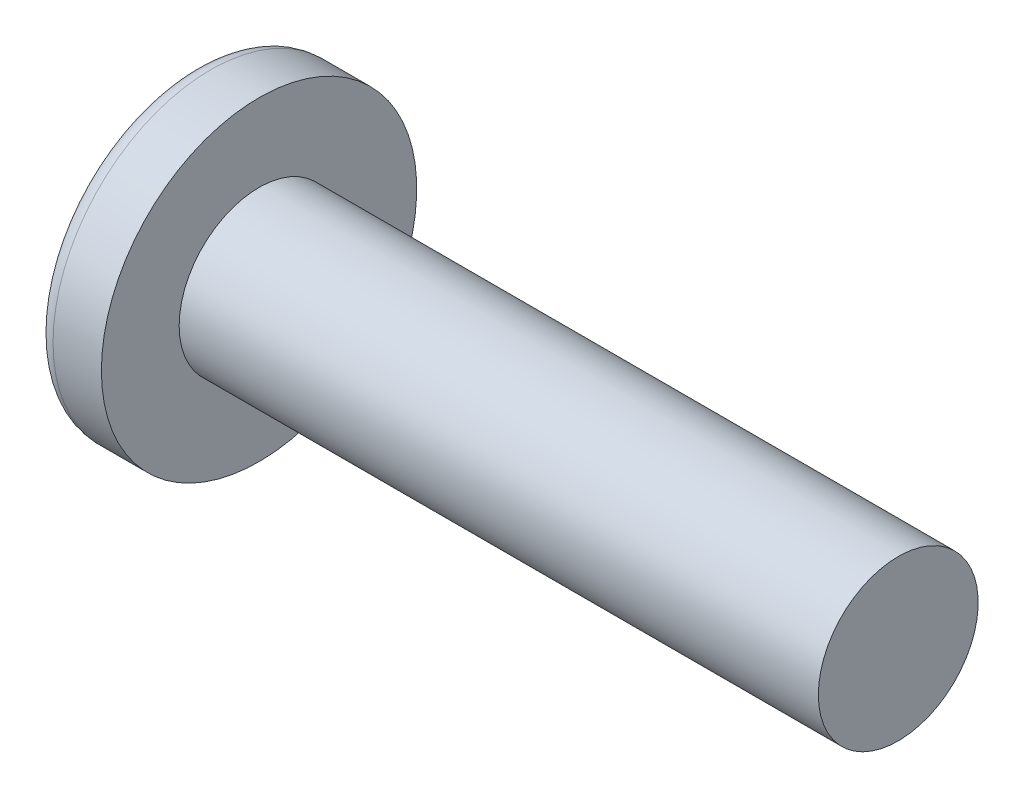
ISO-10303-21;
HEADER;
FILE_DESCRIPTION(('STEP AP214'),'2;1');
FILE_NAME('part.step','',(''),(''),'','','');
FILE_SCHEMA(('AUTOMOTIVE_DESIGN { 1 0 10303 214 1 1 1 1 }'));
ENDSEC;
DATA;
#1=APPLICATION_CONTEXT('core data for automotive mechanical design processes');
#2=APPLICATION_PROTOCOL_DEFINITION('international standard','automotive_design',2000,#1);
#3=PRODUCT_CONTEXT('',#1,'mechanical');
#4=PRODUCT('Part','Part','',(#3));
#5=PRODUCT_RELATED_PRODUCT_CATEGORY('part','',(#4));
#6=PRODUCT_DEFINITION_FORMATION('','',#4);
#7=PRODUCT_DEFINITION_CONTEXT('part definition',#1,'design');
#8=PRODUCT_DEFINITION('design','',#6,#7);
#9=PRODUCT_DEFINITION_SHAPE('','',#8);
#10=(LENGTH_UNIT() NAMED_UNIT(*) SI_UNIT(.MILLI.,.METRE.));
#11=(NAMED_UNIT(*) PLANE_ANGLE_UNIT() SI_UNIT($,.RADIAN.));
#12=(NAMED_UNIT(*) SI_UNIT($,.STERADIAN.) SOLID_ANGLE_UNIT());
#13=UNCERTAINTY_MEASURE_WITH_UNIT(LENGTH_MEASURE(1.E-05),#10,'distance_accuracy_value','');
#14=(GEOMETRIC_REPRESENTATION_CONTEXT(3) GLOBAL_UNCERTAINTY_ASSIGNED_CONTEXT((#13)) GLOBAL_UNIT_ASSIGNED_CONTEXT((#10,
#11,#12)) REPRESENTATION_CONTEXT('',''));
#15=CARTESIAN_POINT('',(0.,0.,0.));
#16=DIRECTION('',(0.,0.,1.));
#17=DIRECTION('',(1.,0.,0.));
#18=AXIS2_PLACEMENT_3D('',#15,#16,#17);
#19=CARTESIAN_POINT('',(15.24,0.,0.));
#20=DIRECTION('',(-1.,0.,0.));
#21=DIRECTION('',(0.,1.,0.));
#22=AXIS2_PLACEMENT_3D('',#19,#20,#21);
#23=SPHERICAL_SURFACE('',#22,15.24);
#24=CARTESIAN_POINT('',(2.92722732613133,0.,0.));
#25=DIRECTION('',(-1.,0.,0.));
#26=DIRECTION('',(0.,0.,1.));
#27=AXIS2_PLACEMENT_3D('',#24,#25,#26);
#28=CIRCLE('',#27,8.98071428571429);
#29=CARTESIAN_POINT('',(2.92722732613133,0.,8.98071428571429));
#30=VERTEX_POINT('',#29);
#31=EDGE_CURVE('E159',#30,#30,#28,.T.);
#32=ORIENTED_EDGE('',*,*,#31,.T.);
#33=EDGE_LOOP('',(#32));
#34=FACE_BOUND('',#33,.T.);
#35=CARTESIAN_POINT('',(15.2364523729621,-0.0501047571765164,0.));
#36=DIRECTION('',(-0.0706273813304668,-0.997502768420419,0.));
#37=DIRECTION('',(0.99750276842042,-0.0706273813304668,0.));
#38=AXIS2_PLACEMENT_3D('',#35,#36,#37);
#39=CIRCLE('',#38,15.239917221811);
#40=CARTESIAN_POINT('',(0.995146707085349,0.95823943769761,5.33137241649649));
#41=VERTEX_POINT('',#40);
#42=CARTESIAN_POINT('',(0.0689357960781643,1.02381905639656,1.02381905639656));
#43=VERTEX_POINT('',#42);
#44=EDGE_CURVE('E190',#41,#43,#39,.T.);
#45=ORIENTED_EDGE('',*,*,#44,.F.);
#46=CARTESIAN_POINT('',(12.5278255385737,0.,-3.52983797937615));
#47=DIRECTION('',(0.609275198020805,0.,0.79295884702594));
#48=DIRECTION('',(0.79295884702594,0.,-0.609275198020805));
#49=AXIS2_PLACEMENT_3D('',#46,#47,#48);
#50=CIRCLE('',#49,14.5753886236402);
#51=CARTESIAN_POINT('',(0.995146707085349,-0.958239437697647,5.33137241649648));
#52=VERTEX_POINT('',#51);
#53=EDGE_CURVE('E155',#41,#52,#50,.T.);
#54=ORIENTED_EDGE('',*,*,#53,.T.);
#55=CARTESIAN_POINT('',(15.2364523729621,0.0501047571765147,0.));
#56=DIRECTION('',(-0.0706273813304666,0.997502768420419,0.));
#57=DIRECTION('',(-0.99750276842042,-0.0706273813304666,0.));
#58=AXIS2_PLACEMENT_3D('',#55,#56,#57);
#59=CIRCLE('',#58,15.239917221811);
#60=CARTESIAN_POINT('',(0.0689357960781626,-1.02381905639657,1.02381905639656));
#61=VERTEX_POINT('',#60);
#62=EDGE_CURVE('E111',#61,#52,#59,.T.);
#63=ORIENTED_EDGE('',*,*,#62,.F.);
#64=CARTESIAN_POINT('',(15.2364523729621,0.,-0.0501047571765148));
#65=DIRECTION('',(-0.0706273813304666,0.,-0.997502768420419));
#66=DIRECTION('',(-0.99750276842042,0.,0.0706273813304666));
#67=AXIS2_PLACEMENT_3D('',#64,#65,#66);
#68=CIRCLE('',#67,15.239917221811);
#69=CARTESIAN_POINT('',(0.995146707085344,-5.33137241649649,0.958239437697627));
#70=VERTEX_POINT('',#69);
#71=EDGE_CURVE('E136',#70,#61,#68,.T.);
#72=ORIENTED_EDGE('',*,*,#71,.F.);
#73=CARTESIAN_POINT('',(12.5278255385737,3.52983797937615,0.));
#74=DIRECTION('',(0.609275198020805,-0.79295884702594,0.));
#75=DIRECTION('',(0.79295884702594,0.609275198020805,0.));
#76=AXIS2_PLACEMENT_3D('',#73,#74,#75);
#77=CIRCLE('',#76,14.5753886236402);
#78=CARTESIAN_POINT('',(0.995146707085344,-5.33137241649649,-0.958239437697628));
#79=VERTEX_POINT('',#78);
#80=EDGE_CURVE('E144',#70,#79,#77,.T.);
#81=ORIENTED_EDGE('',*,*,#80,.T.);
#82=CARTESIAN_POINT('',(15.2364523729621,0.,0.0501047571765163));
#83=DIRECTION('',(-0.0706273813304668,0.,0.997502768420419));
#84=DIRECTION('',(0.99750276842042,0.,0.0706273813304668));
#85=AXIS2_PLACEMENT_3D('',#82,#83,#84);
#86=CIRCLE('',#85,15.239917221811);
#87=CARTESIAN_POINT('',(0.0689357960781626,-1.02381905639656,-1.02381905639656));
#88=VERTEX_POINT('',#87);
#89=EDGE_CURVE('E54',#88,#79,#86,.T.);
#90=ORIENTED_EDGE('',*,*,#89,.F.);
#91=CARTESIAN_POINT('',(0.995146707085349,-0.958239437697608,-5.33137241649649));
#92=VERTEX_POINT('',#91);
#93=EDGE_CURVE('E197',#92,#88,#59,.T.);
#94=ORIENTED_EDGE('',*,*,#93,.F.);
#95=CARTESIAN_POINT('',(12.5278255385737,0.,3.52983797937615));
#96=DIRECTION('',(0.609275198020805,0.,-0.79295884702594));
#97=DIRECTION('',(-0.79295884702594,0.,-0.609275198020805));
#98=AXIS2_PLACEMENT_3D('',#95,#96,#97);
#99=CIRCLE('',#98,14.5753886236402);
#100=CARTESIAN_POINT('',(0.995146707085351,0.958239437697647,-5.33137241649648));
#101=VERTEX_POINT('',#100);
#102=EDGE_CURVE('E137',#92,#101,#99,.T.);
#103=ORIENTED_EDGE('',*,*,#102,.T.);
#104=CARTESIAN_POINT('',(0.0689357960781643,1.02381905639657,-1.02381905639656));
#105=VERTEX_POINT('',#104);
#106=EDGE_CURVE('E185',#105,#101,#39,.T.);
#107=ORIENTED_EDGE('',*,*,#106,.F.);
#108=CARTESIAN_POINT('',(0.995146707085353,5.33137241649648,-0.958239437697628));
#109=VERTEX_POINT('',#108);
#110=EDGE_CURVE('E47',#109,#105,#86,.T.);
#111=ORIENTED_EDGE('',*,*,#110,.F.);
#112=CARTESIAN_POINT('',(12.5278255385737,-3.52983797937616,0.));
#113=DIRECTION('',(0.609275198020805,0.79295884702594,0.));
#114=DIRECTION('',(-0.79295884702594,0.609275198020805,0.));
#115=AXIS2_PLACEMENT_3D('',#112,#113,#114);
#116=CIRCLE('',#115,14.5753886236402);
#117=CARTESIAN_POINT('',(0.995146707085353,5.33137241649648,0.958239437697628));
#118=VERTEX_POINT('',#117);
#119=EDGE_CURVE('E11',#109,#118,#116,.T.);
#120=ORIENTED_EDGE('',*,*,#119,.T.);
#121=EDGE_CURVE('E173',#43,#118,#68,.T.);
#122=ORIENTED_EDGE('',*,*,#121,.F.);
#123=EDGE_LOOP('',(#45,#54,#63,#72,#81,#90,#94,#103,#107,#111,#120,#122));
#124=FACE_BOUND('',#123,.T.);
#125=ADVANCED_FACE('F39',(#34,#124),#23,.T.);
#126=CARTESIAN_POINT('',(7.9338156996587,0.,-0.466952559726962));
#127=DIRECTION('',(-0.0706273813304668,0.,0.997502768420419));
#128=DIRECTION('',(0.99750276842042,0.,0.0706273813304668));
#129=AXIS2_PLACEMENT_3D('',#126,#127,#128);
#130=PLANE('',#129);
#131=ORIENTED_EDGE('',*,*,#110,.T.);
#132=DIRECTION('',(0.995024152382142,-0.0704518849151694,0.0704518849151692));
#133=VECTOR('',#132,1.);
#134=CARTESIAN_POINT('',(7.96654969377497,0.464634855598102,-0.464634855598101));
#135=LINE('',#134,#133);
#136=CARTESIAN_POINT('',(7.2644,0.514350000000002,-0.514349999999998));
#137=VERTEX_POINT('',#136);
#138=EDGE_CURVE('E179',#105,#137,#135,.T.);
#139=ORIENTED_EDGE('',*,*,#138,.T.);
#140=DIRECTION('',(0.791711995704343,-0.608317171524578,0.056056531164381));
#141=VECTOR('',#140,1.);
#142=CARTESIAN_POINT('',(0.,6.096,-1.0287));
#143=LINE('',#142,#141);
#144=EDGE_CURVE('E160',#109,#137,#143,.T.);
#145=ORIENTED_EDGE('',*,*,#144,.F.);
#146=EDGE_LOOP('',(#131,#139,#145));
#147=FACE_BOUND('',#146,.T.);
#148=ADVANCED_FACE('F178',(#147),#130,.T.);
#149=DIRECTION('',(0.791711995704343,0.608317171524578,0.056056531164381));
#150=VECTOR('',#149,1.);
#151=CARTESIAN_POINT('',(0.,-6.096,-1.0287));
#152=LINE('',#151,#150);
#153=CARTESIAN_POINT('',(7.2644,-0.51435,-0.51435));
#154=VERTEX_POINT('',#153);
#155=EDGE_CURVE('E145',#79,#154,#152,.T.);
#156=ORIENTED_EDGE('',*,*,#155,.T.);
#157=DIRECTION('',(-0.995024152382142,-0.0704518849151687,-0.0704518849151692));
#158=VECTOR('',#157,1.);
#159=CARTESIAN_POINT('',(7.96654969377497,-0.464634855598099,-0.464634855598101));
#160=LINE('',#159,#158);
#161=EDGE_CURVE('E200',#154,#88,#160,.T.);
#162=ORIENTED_EDGE('',*,*,#161,.T.);
#163=ORIENTED_EDGE('',*,*,#89,.T.);
#164=EDGE_LOOP('',(#156,#162,#163));
#165=FACE_BOUND('',#164,.T.);
#166=ADVANCED_FACE('F215',(#165),#130,.T.);
#167=CARTESIAN_POINT('',(7.9338156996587,0.,0.466952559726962));
#168=DIRECTION('',(-0.0706273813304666,0.,-0.997502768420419));
#169=DIRECTION('',(-0.99750276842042,0.,0.0706273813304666));
#170=AXIS2_PLACEMENT_3D('',#167,#168,#169);
#171=PLANE('',#170);
#172=DIRECTION('',(0.791711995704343,-0.608317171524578,-0.0560565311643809));
#173=VECTOR('',#172,1.);
#174=CARTESIAN_POINT('',(0.,6.096,1.0287));
#175=LINE('',#174,#173);
#176=CARTESIAN_POINT('',(7.2644,0.51435,0.51435));
#177=VERTEX_POINT('',#176);
#178=EDGE_CURVE('E216',#118,#177,#175,.T.);
#179=ORIENTED_EDGE('',*,*,#178,.T.);
#180=DIRECTION('',(-0.995024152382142,0.0704518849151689,0.070451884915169));
#181=VECTOR('',#180,1.);
#182=CARTESIAN_POINT('',(7.96654969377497,0.464634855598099,0.464634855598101));
#183=LINE('',#182,#181);
#184=EDGE_CURVE('E194',#177,#43,#183,.T.);
#185=ORIENTED_EDGE('',*,*,#184,.T.);
#186=ORIENTED_EDGE('',*,*,#121,.T.);
#187=EDGE_LOOP('',(#179,#185,#186));
#188=FACE_BOUND('',#187,.T.);
#189=ADVANCED_FACE('F220',(#188),#171,.T.);
#190=ORIENTED_EDGE('',*,*,#71,.T.);
#191=DIRECTION('',(0.995024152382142,0.0704518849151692,-0.070451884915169));
#192=VECTOR('',#191,1.);
#193=CARTESIAN_POINT('',(7.96654969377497,-0.464634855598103,0.464634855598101));
#194=LINE('',#193,#192);
#195=CARTESIAN_POINT('',(7.2644,-0.514350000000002,0.514349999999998));
#196=VERTEX_POINT('',#195);
#197=EDGE_CURVE('E109',#61,#196,#194,.T.);
#198=ORIENTED_EDGE('',*,*,#197,.T.);
#199=DIRECTION('',(0.791711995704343,0.608317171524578,-0.0560565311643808));
#200=VECTOR('',#199,1.);
#201=CARTESIAN_POINT('',(0.,-6.096,1.0287));
#202=LINE('',#201,#200);
#203=EDGE_CURVE('E134',#70,#196,#202,.T.);
#204=ORIENTED_EDGE('',*,*,#203,.F.);
#205=EDGE_LOOP('',(#190,#198,#204));
#206=FACE_BOUND('',#205,.T.);
#207=ADVANCED_FACE('F133',(#206),#171,.T.);
#208=CARTESIAN_POINT('',(-25.4,0.,0.));
#209=DIRECTION('',(-1.,0.,0.));
#210=DIRECTION('',(0.,0.,1.));
#211=AXIS2_PLACEMENT_3D('',#208,#209,#210);
#212=CYLINDRICAL_SURFACE('',#211,4.7625);
#213=CARTESIAN_POINT('',(44.7294,0.,0.));
#214=DIRECTION('',(-1.,0.,0.));
#215=DIRECTION('',(0.,0.,1.));
#216=AXIS2_PLACEMENT_3D('',#213,#214,#215);
#217=CIRCLE('',#216,4.7625);
#218=CARTESIAN_POINT('',(44.7294,0.,4.7625));
#219=VERTEX_POINT('',#218);
#220=EDGE_CURVE('E156',#219,#219,#217,.T.);
#221=ORIENTED_EDGE('',*,*,#220,.T.);
#222=EDGE_LOOP('',(#221));
#223=FACE_BOUND('',#222,.T.);
#224=CARTESIAN_POINT('',(6.6294,0.,0.));
#225=DIRECTION('',(-1.,0.,0.));
#226=DIRECTION('',(0.,0.,1.));
#227=AXIS2_PLACEMENT_3D('',#224,#225,#226);
#228=CIRCLE('',#227,4.7625);
#229=CARTESIAN_POINT('',(6.6294,0.,4.7625));
#230=VERTEX_POINT('',#229);
#231=EDGE_CURVE('E169',#230,#230,#228,.T.);
#232=ORIENTED_EDGE('',*,*,#231,.F.);
#233=EDGE_LOOP('',(#232));
#234=FACE_BOUND('',#233,.T.);
#235=ADVANCED_FACE('F41',(#223,#234),#212,.T.);
#236=CARTESIAN_POINT('',(6.6294,4.7625,0.));
#237=DIRECTION('',(-1.,0.,0.));
#238=DIRECTION('',(0.,0.,1.));
#239=AXIS2_PLACEMENT_3D('',#236,#237,#238);
#240=PLANE('',#239);
#241=CARTESIAN_POINT('',(6.6294,0.,0.));
#242=DIRECTION('',(-1.,0.,0.));
#243=DIRECTION('',(0.,0.,1.));
#244=AXIS2_PLACEMENT_3D('',#241,#242,#243);
#245=CIRCLE('',#244,9.398);
#246=CARTESIAN_POINT('',(6.6294,0.,9.398));
#247=VERTEX_POINT('',#246);
#248=EDGE_CURVE('E166',#247,#247,#245,.T.);
#249=ORIENTED_EDGE('',*,*,#248,.F.);
#250=EDGE_LOOP('',(#249));
#251=FACE_BOUND('',#250,.T.);
#252=ORIENTED_EDGE('',*,*,#231,.T.);
#253=EDGE_LOOP('',(#252));
#254=FACE_BOUND('',#253,.T.);
#255=ADVANCED_FACE('F249',(#251,#254),#240,.F.);
#256=CARTESIAN_POINT('',(-25.4,0.,0.));
#257=DIRECTION('',(-1.,0.,0.));
#258=DIRECTION('',(0.,0.,1.));
#259=AXIS2_PLACEMENT_3D('',#256,#257,#258);
#260=CYLINDRICAL_SURFACE('',#259,9.398);
#261=ORIENTED_EDGE('',*,*,#248,.T.);
#262=EDGE_LOOP('',(#261));
#263=FACE_BOUND('',#262,.T.);
#264=CARTESIAN_POINT('',(3.74807883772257,0.,0.));
#265=DIRECTION('',(-1.,0.,0.));
#266=DIRECTION('',(0.,0.,1.));
#267=AXIS2_PLACEMENT_3D('',#264,#265,#266);
#268=CIRCLE('',#267,9.398);
#269=CARTESIAN_POINT('',(3.74807883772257,0.,9.398));
#270=VERTEX_POINT('',#269);
#271=EDGE_CURVE('E163',#270,#270,#268,.T.);
#272=ORIENTED_EDGE('',*,*,#271,.F.);
#273=EDGE_LOOP('',(#272));
#274=FACE_BOUND('',#273,.T.);
#275=ADVANCED_FACE('F246',(#263,#274),#260,.T.);
#276=CARTESIAN_POINT('',(3.74807883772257,0.,0.));
#277=DIRECTION('',(-1.,0.,0.));
#278=DIRECTION('',(0.,0.,1.));
#279=AXIS2_PLACEMENT_3D('',#276,#277,#278);
#280=TOROIDAL_SURFACE('',#279,8.382,1.016);
#281=ORIENTED_EDGE('',*,*,#271,.T.);
#282=EDGE_LOOP('',(#281));
#283=FACE_BOUND('',#282,.T.);
#284=ORIENTED_EDGE('',*,*,#31,.F.);
#285=EDGE_LOOP('',(#284));
#286=FACE_BOUND('',#285,.T.);
#287=ADVANCED_FACE('F243',(#283,#286),#280,.T.);
#288=CARTESIAN_POINT('',(44.7294,4.7625,0.));
#289=DIRECTION('',(1.,0.,0.));
#290=DIRECTION('',(0.,0.,-1.));
#291=AXIS2_PLACEMENT_3D('',#288,#289,#290);
#292=PLANE('',#291);
#293=ORIENTED_EDGE('',*,*,#220,.F.);
#294=EDGE_LOOP('',(#293));
#295=FACE_BOUND('',#294,.T.);
#296=ADVANCED_FACE('F241',(#295),#292,.T.);
#297=CARTESIAN_POINT('',(0.,6.096,1.0287));
#298=DIRECTION('',(0.609275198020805,0.79295884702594,0.));
#299=DIRECTION('',(-0.79295884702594,0.609275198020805,0.));
#300=AXIS2_PLACEMENT_3D('',#297,#298,#299);
#301=PLANE('',#300);
#302=ORIENTED_EDGE('',*,*,#144,.T.);
#303=DIRECTION('',(0.,0.,-1.));
#304=VECTOR('',#303,1.);
#305=CARTESIAN_POINT('',(7.2644,0.51435,0.51435));
#306=LINE('',#305,#304);
#307=EDGE_CURVE('E127',#177,#137,#306,.T.);
#308=ORIENTED_EDGE('',*,*,#307,.F.);
#309=ORIENTED_EDGE('',*,*,#178,.F.);
#310=ORIENTED_EDGE('',*,*,#119,.F.);
#311=EDGE_LOOP('',(#302,#308,#309,#310));
#312=FACE_BOUND('',#311,.T.);
#313=ADVANCED_FACE('F219',(#312),#301,.F.);
#314=CARTESIAN_POINT('',(7.2644,-0.51435,-0.51435));
#315=DIRECTION('',(0.609275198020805,-0.79295884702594,0.));
#316=DIRECTION('',(0.79295884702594,0.609275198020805,0.));
#317=AXIS2_PLACEMENT_3D('',#314,#315,#316);
#318=PLANE('',#317);
#319=ORIENTED_EDGE('',*,*,#203,.T.);
#320=DIRECTION('',(0.,0.,1.));
#321=VECTOR('',#320,1.);
#322=CARTESIAN_POINT('',(7.2644,-0.51435,-0.51435));
#323=LINE('',#322,#321);
#324=EDGE_CURVE('E126',#154,#196,#323,.T.);
#325=ORIENTED_EDGE('',*,*,#324,.F.);
#326=ORIENTED_EDGE('',*,*,#155,.F.);
#327=ORIENTED_EDGE('',*,*,#80,.F.);
#328=EDGE_LOOP('',(#319,#325,#326,#327));
#329=FACE_BOUND('',#328,.T.);
#330=ADVANCED_FACE('F141',(#329),#318,.F.);
#331=CARTESIAN_POINT('',(7.2644,0.51435,-0.51435));
#332=DIRECTION('',(-1.,0.,0.));
#333=DIRECTION('',(0.,0.,1.));
#334=AXIS2_PLACEMENT_3D('',#331,#332,#333);
#335=PLANE('',#334);
#336=DIRECTION('',(0.,1.,0.));
#337=VECTOR('',#336,1.);
#338=CARTESIAN_POINT('',(7.2644,-0.51435,-0.51435));
#339=LINE('',#338,#337);
#340=EDGE_CURVE('E149',#154,#137,#339,.T.);
#341=ORIENTED_EDGE('',*,*,#340,.F.);
#342=ORIENTED_EDGE('',*,*,#324,.T.);
#343=DIRECTION('',(0.,-1.,0.));
#344=VECTOR('',#343,1.);
#345=CARTESIAN_POINT('',(7.2644,0.51435,0.51435));
#346=LINE('',#345,#344);
#347=EDGE_CURVE('E118',#177,#196,#346,.T.);
#348=ORIENTED_EDGE('',*,*,#347,.F.);
#349=ORIENTED_EDGE('',*,*,#307,.T.);
#350=EDGE_LOOP('',(#341,#342,#348,#349));
#351=FACE_BOUND('',#350,.T.);
#352=ADVANCED_FACE('F147',(#351),#335,.T.);
#353=CARTESIAN_POINT('',(7.2644,0.514350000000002,-0.514349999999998));
#354=DIRECTION('',(0.609275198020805,0.,-0.79295884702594));
#355=DIRECTION('',(0.79295884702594,0.,0.609275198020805));
#356=AXIS2_PLACEMENT_3D('',#353,#354,#355);
#357=PLANE('',#356);
#358=DIRECTION('',(0.791711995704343,0.0560565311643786,0.608317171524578));
#359=VECTOR('',#358,1.);
#360=CARTESIAN_POINT('',(0.,-1.02869999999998,-6.096));
#361=LINE('',#360,#359);
#362=EDGE_CURVE('E205',#92,#154,#361,.T.);
#363=ORIENTED_EDGE('',*,*,#362,.T.);
#364=ORIENTED_EDGE('',*,*,#340,.T.);
#365=DIRECTION('',(0.791711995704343,-0.0560565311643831,0.608317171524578));
#366=VECTOR('',#365,1.);
#367=CARTESIAN_POINT('',(0.,1.02870000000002,-6.096));
#368=LINE('',#367,#366);
#369=EDGE_CURVE('E115',#101,#137,#368,.T.);
#370=ORIENTED_EDGE('',*,*,#369,.F.);
#371=ORIENTED_EDGE('',*,*,#102,.F.);
#372=EDGE_LOOP('',(#363,#364,#370,#371));
#373=FACE_BOUND('',#372,.T.);
#374=ADVANCED_FACE('F210',(#373),#357,.F.);
#375=CARTESIAN_POINT('',(7.9338156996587,-0.466952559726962,0.));
#376=DIRECTION('',(-0.0706273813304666,0.997502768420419,0.));
#377=DIRECTION('',(-0.99750276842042,-0.0706273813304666,0.));
#378=AXIS2_PLACEMENT_3D('',#375,#376,#377);
#379=PLANE('',#378);
#380=ORIENTED_EDGE('',*,*,#93,.T.);
#381=ORIENTED_EDGE('',*,*,#161,.F.);
#382=ORIENTED_EDGE('',*,*,#362,.F.);
#383=EDGE_LOOP('',(#380,#381,#382));
#384=FACE_BOUND('',#383,.T.);
#385=ADVANCED_FACE('F214',(#384),#379,.T.);
#386=CARTESIAN_POINT('',(7.9338156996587,0.466952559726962,0.));
#387=DIRECTION('',(-0.0706273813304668,-0.997502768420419,0.));
#388=DIRECTION('',(0.99750276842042,-0.0706273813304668,0.));
#389=AXIS2_PLACEMENT_3D('',#386,#387,#388);
#390=PLANE('',#389);
#391=ORIENTED_EDGE('',*,*,#106,.T.);
#392=ORIENTED_EDGE('',*,*,#369,.T.);
#393=ORIENTED_EDGE('',*,*,#138,.F.);
#394=EDGE_LOOP('',(#391,#392,#393));
#395=FACE_BOUND('',#394,.T.);
#396=ADVANCED_FACE('F208',(#395),#390,.T.);
#397=CARTESIAN_POINT('',(0.,-1.02870000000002,6.096));
#398=DIRECTION('',(0.609275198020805,0.,0.79295884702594));
#399=DIRECTION('',(-0.79295884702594,0.,0.609275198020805));
#400=AXIS2_PLACEMENT_3D('',#397,#398,#399);
#401=PLANE('',#400);
#402=DIRECTION('',(0.791711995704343,-0.0560565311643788,-0.608317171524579));
#403=VECTOR('',#402,1.);
#404=CARTESIAN_POINT('',(0.,1.02869999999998,6.096));
#405=LINE('',#404,#403);
#406=EDGE_CURVE('E114',#41,#177,#405,.T.);
#407=ORIENTED_EDGE('',*,*,#406,.T.);
#408=ORIENTED_EDGE('',*,*,#347,.T.);
#409=DIRECTION('',(0.791711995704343,0.056056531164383,-0.608317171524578));
#410=VECTOR('',#409,1.);
#411=CARTESIAN_POINT('',(0.,-1.02870000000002,6.096));
#412=LINE('',#411,#410);
#413=EDGE_CURVE('E105',#52,#196,#412,.T.);
#414=ORIENTED_EDGE('',*,*,#413,.F.);
#415=ORIENTED_EDGE('',*,*,#53,.F.);
#416=EDGE_LOOP('',(#407,#408,#414,#415));
#417=FACE_BOUND('',#416,.T.);
#418=ADVANCED_FACE('F119',(#417),#401,.F.);
#419=ORIENTED_EDGE('',*,*,#44,.T.);
#420=ORIENTED_EDGE('',*,*,#184,.F.);
#421=ORIENTED_EDGE('',*,*,#406,.F.);
#422=EDGE_LOOP('',(#419,#420,#421));
#423=FACE_BOUND('',#422,.T.);
#424=ADVANCED_FACE('F221',(#423),#390,.T.);
#425=ORIENTED_EDGE('',*,*,#62,.T.);
#426=ORIENTED_EDGE('',*,*,#413,.T.);
#427=ORIENTED_EDGE('',*,*,#197,.F.);
#428=EDGE_LOOP('',(#425,#426,#427));
#429=FACE_BOUND('',#428,.T.);
#430=ADVANCED_FACE('F107',(#429),#379,.T.);
#431=CLOSED_SHELL('',(#125,#148,#166,#189,#207,#235,#255,#275,#287,#296,#313,#330,#352,#374,
#385,#396,#418,#424,#430));
#432=MANIFOLD_SOLID_BREP('B2',#431);
#433=ADVANCED_BREP_SHAPE_REPRESENTATION('',(#18,#432),#14);
#434=SHAPE_DEFINITION_REPRESENTATION(#9,#433);
ENDSEC;
END-ISO-10303-21;
